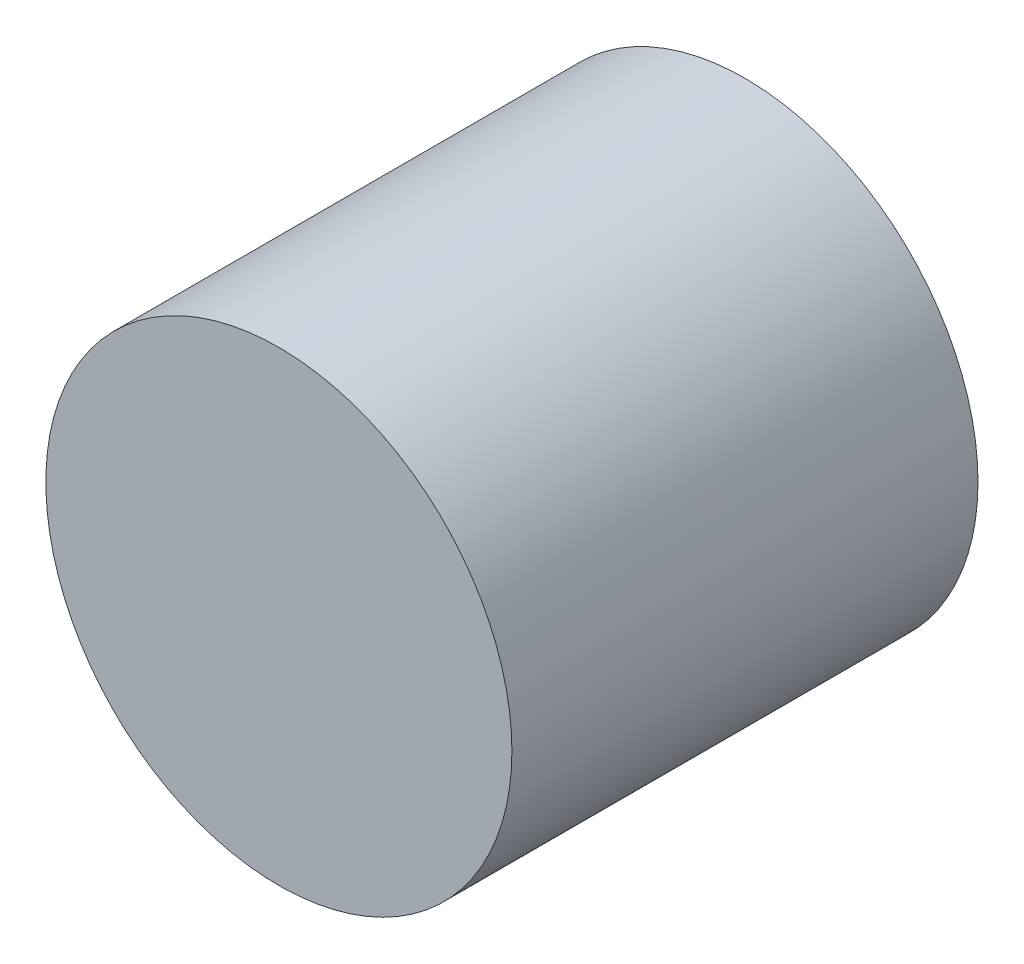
ISO-10303-21;
HEADER;
FILE_DESCRIPTION(('STEP AP214'),'2;1');
FILE_NAME('part.step','',(''),(''),'','','');
FILE_SCHEMA(('AUTOMOTIVE_DESIGN { 1 0 10303 214 1 1 1 1 }'));
ENDSEC;
DATA;
#1=APPLICATION_CONTEXT('core data for automotive mechanical design processes');
#2=APPLICATION_PROTOCOL_DEFINITION('international standard','automotive_design',2000,#1);
#3=PRODUCT_CONTEXT('',#1,'mechanical');
#4=PRODUCT('Part','Part','',(#3));
#5=PRODUCT_RELATED_PRODUCT_CATEGORY('part','',(#4));
#6=PRODUCT_DEFINITION_FORMATION('','',#4);
#7=PRODUCT_DEFINITION_CONTEXT('part definition',#1,'design');
#8=PRODUCT_DEFINITION('design','',#6,#7);
#9=PRODUCT_DEFINITION_SHAPE('','',#8);
#10=(LENGTH_UNIT() NAMED_UNIT(*) SI_UNIT(.MILLI.,.METRE.));
#11=(NAMED_UNIT(*) PLANE_ANGLE_UNIT() SI_UNIT($,.RADIAN.));
#12=(NAMED_UNIT(*) SI_UNIT($,.STERADIAN.) SOLID_ANGLE_UNIT());
#13=UNCERTAINTY_MEASURE_WITH_UNIT(LENGTH_MEASURE(1.E-05),#10,'distance_accuracy_value','');
#14=(GEOMETRIC_REPRESENTATION_CONTEXT(3) GLOBAL_UNCERTAINTY_ASSIGNED_CONTEXT((#13)) GLOBAL_UNIT_ASSIGNED_CONTEXT((#10,
#11,#12)) REPRESENTATION_CONTEXT('',''));
#15=CARTESIAN_POINT('',(0.,0.,0.));
#16=DIRECTION('',(0.,0.,1.));
#17=DIRECTION('',(1.,0.,0.));
#18=AXIS2_PLACEMENT_3D('',#15,#16,#17);
#19=CARTESIAN_POINT('',(0.,0.,75.));
#20=DIRECTION('',(0.,0.,1.));
#21=DIRECTION('',(1.,0.,0.));
#22=AXIS2_PLACEMENT_3D('',#19,#20,#21);
#23=PLANE('',#22);
#24=CARTESIAN_POINT('',(0.,0.,75.));
#25=DIRECTION('',(0.,0.,1.));
#26=DIRECTION('',(1.,0.,0.));
#27=AXIS2_PLACEMENT_3D('',#24,#25,#26);
#28=CIRCLE('',#27,37.5);
#29=CARTESIAN_POINT('',(37.5,0.,75.));
#30=VERTEX_POINT('',#29);
#31=EDGE_CURVE('E10',#30,#30,#28,.T.);
#32=ORIENTED_EDGE('',*,*,#31,.T.);
#33=EDGE_LOOP('',(#32));
#34=FACE_BOUND('',#33,.T.);
#35=ADVANCED_FACE('F16',(#34),#23,.T.);
#36=CARTESIAN_POINT('',(0.,0.,0.));
#37=DIRECTION('',(0.,0.,1.));
#38=DIRECTION('',(1.,0.,0.));
#39=AXIS2_PLACEMENT_3D('',#36,#37,#38);
#40=PLANE('',#39);
#41=CARTESIAN_POINT('',(0.,0.,0.));
#42=DIRECTION('',(0.,0.,1.));
#43=DIRECTION('',(1.,0.,0.));
#44=AXIS2_PLACEMENT_3D('',#41,#42,#43);
#45=CIRCLE('',#44,37.5);
#46=CARTESIAN_POINT('',(37.5,0.,0.));
#47=VERTEX_POINT('',#46);
#48=EDGE_CURVE('E42',#47,#47,#45,.T.);
#49=ORIENTED_EDGE('',*,*,#48,.F.);
#50=EDGE_LOOP('',(#49));
#51=FACE_BOUND('',#50,.T.);
#52=ADVANCED_FACE('F55',(#51),#40,.F.);
#53=CARTESIAN_POINT('',(0.,0.,0.));
#54=DIRECTION('',(0.,0.,-1.));
#55=DIRECTION('',(1.,0.,0.));
#56=AXIS2_PLACEMENT_3D('',#53,#54,#55);
#57=CYLINDRICAL_SURFACE('',#56,37.5);
#58=ORIENTED_EDGE('',*,*,#48,.T.);
#59=DIRECTION('',(0.,0.,1.));
#60=VECTOR('',#59,1.);
#61=CARTESIAN_POINT('',(37.5,0.,0.));
#62=LINE('',#61,#60);
#63=EDGE_CURVE('E19',#47,#30,#62,.T.);
#64=ORIENTED_EDGE('',*,*,#63,.T.);
#65=ORIENTED_EDGE('',*,*,#31,.F.);
#66=ORIENTED_EDGE('',*,*,#63,.F.);
#67=EDGE_LOOP('',(#58,#64,#65,#66));
#68=FACE_BOUND('',#67,.T.);
#69=ADVANCED_FACE('F40',(#68),#57,.T.);
#70=CLOSED_SHELL('',(#35,#52,#69));
#71=MANIFOLD_SOLID_BREP('B1',#70);
#72=ADVANCED_BREP_SHAPE_REPRESENTATION('',(#18,#71),#14);
#73=SHAPE_DEFINITION_REPRESENTATION(#9,#72);
ENDSEC;
END-ISO-10303-21;
